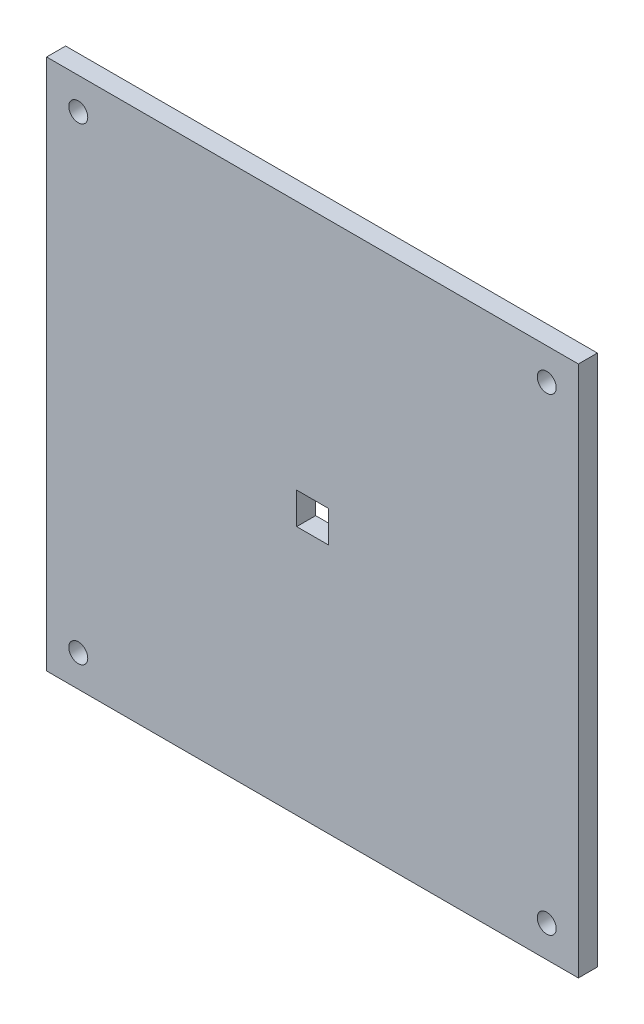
ISO-10303-21;
HEADER;
FILE_DESCRIPTION(('STEP AP214'),'2;1');
FILE_NAME('part.step','',(''),(''),'','','');
FILE_SCHEMA(('AUTOMOTIVE_DESIGN { 1 0 10303 214 1 1 1 1 }'));
ENDSEC;
DATA;
#1=APPLICATION_CONTEXT('core data for automotive mechanical design processes');
#2=APPLICATION_PROTOCOL_DEFINITION('international standard','automotive_design',2000,#1);
#3=PRODUCT_CONTEXT('',#1,'mechanical');
#4=PRODUCT('Part','Part','',(#3));
#5=PRODUCT_RELATED_PRODUCT_CATEGORY('part','',(#4));
#6=PRODUCT_DEFINITION_FORMATION('','',#4);
#7=PRODUCT_DEFINITION_CONTEXT('part definition',#1,'design');
#8=PRODUCT_DEFINITION('design','',#6,#7);
#9=PRODUCT_DEFINITION_SHAPE('','',#8);
#10=(LENGTH_UNIT() NAMED_UNIT(*) SI_UNIT(.MILLI.,.METRE.));
#11=(NAMED_UNIT(*) PLANE_ANGLE_UNIT() SI_UNIT($,.RADIAN.));
#12=(NAMED_UNIT(*) SI_UNIT($,.STERADIAN.) SOLID_ANGLE_UNIT());
#13=UNCERTAINTY_MEASURE_WITH_UNIT(LENGTH_MEASURE(1.E-05),#10,'distance_accuracy_value','');
#14=(GEOMETRIC_REPRESENTATION_CONTEXT(3) GLOBAL_UNCERTAINTY_ASSIGNED_CONTEXT((#13)) GLOBAL_UNIT_ASSIGNED_CONTEXT((#10,
#11,#12)) REPRESENTATION_CONTEXT('',''));
#15=CARTESIAN_POINT('',(0.,0.,0.));
#16=DIRECTION('',(0.,0.,1.));
#17=DIRECTION('',(1.,0.,0.));
#18=AXIS2_PLACEMENT_3D('',#15,#16,#17);
#19=CARTESIAN_POINT('',(0.,0.,3.));
#20=DIRECTION('',(0.,0.,1.));
#21=DIRECTION('',(1.,0.,0.));
#22=AXIS2_PLACEMENT_3D('',#19,#20,#21);
#23=PLANE('',#22);
#24=CARTESIAN_POINT('',(37.0000000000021,-36.9999999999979,3.));
#25=DIRECTION('',(0.,0.,1.));
#26=DIRECTION('',(1.,0.,0.));
#27=AXIS2_PLACEMENT_3D('',#24,#25,#26);
#28=CIRCLE('',#27,1.50000000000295);
#29=CARTESIAN_POINT('',(38.500000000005,-36.9999999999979,3.));
#30=VERTEX_POINT('',#29);
#31=EDGE_CURVE('E245',#30,#30,#28,.T.);
#32=ORIENTED_EDGE('',*,*,#31,.F.);
#33=EDGE_LOOP('',(#32));
#34=FACE_BOUND('',#33,.T.);
#35=CARTESIAN_POINT('',(-37.,37.,3.));
#36=DIRECTION('',(0.,0.,1.));
#37=DIRECTION('',(1.,0.,0.));
#38=AXIS2_PLACEMENT_3D('',#35,#36,#37);
#39=CIRCLE('',#38,1.5);
#40=CARTESIAN_POINT('',(-35.5,37.,3.));
#41=VERTEX_POINT('',#40);
#42=EDGE_CURVE('E127',#41,#41,#39,.T.);
#43=ORIENTED_EDGE('',*,*,#42,.F.);
#44=EDGE_LOOP('',(#43));
#45=FACE_BOUND('',#44,.T.);
#46=DIRECTION('',(0.,1.,0.));
#47=VECTOR('',#46,1.);
#48=CARTESIAN_POINT('',(42.,42.,3.));
#49=LINE('',#48,#47);
#50=CARTESIAN_POINT('',(42.,-42.,3.));
#51=VERTEX_POINT('',#50);
#52=CARTESIAN_POINT('',(42.,42.,3.));
#53=VERTEX_POINT('',#52);
#54=EDGE_CURVE('E137',#51,#53,#49,.T.);
#55=ORIENTED_EDGE('',*,*,#54,.T.);
#56=DIRECTION('',(-1.,0.,0.));
#57=VECTOR('',#56,1.);
#58=CARTESIAN_POINT('',(-42.,42.,3.));
#59=LINE('',#58,#57);
#60=CARTESIAN_POINT('',(-42.,42.,3.));
#61=VERTEX_POINT('',#60);
#62=EDGE_CURVE('E140',#53,#61,#59,.T.);
#63=ORIENTED_EDGE('',*,*,#62,.T.);
#64=DIRECTION('',(0.,-1.,0.));
#65=VECTOR('',#64,1.);
#66=CARTESIAN_POINT('',(-42.,42.,3.));
#67=LINE('',#66,#65);
#68=CARTESIAN_POINT('',(-42.,-42.,3.));
#69=VERTEX_POINT('',#68);
#70=EDGE_CURVE('E143',#61,#69,#67,.T.);
#71=ORIENTED_EDGE('',*,*,#70,.T.);
#72=DIRECTION('',(1.,0.,0.));
#73=VECTOR('',#72,1.);
#74=CARTESIAN_POINT('',(-42.,-42.,3.));
#75=LINE('',#74,#73);
#76=EDGE_CURVE('E145',#69,#51,#75,.T.);
#77=ORIENTED_EDGE('',*,*,#76,.T.);
#78=EDGE_LOOP('',(#55,#63,#71,#77));
#79=FACE_BOUND('',#78,.T.);
#80=DIRECTION('',(-1.,0.,0.));
#81=VECTOR('',#80,1.);
#82=CARTESIAN_POINT('',(-2.50000000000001,2.50000000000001,3.));
#83=LINE('',#82,#81);
#84=CARTESIAN_POINT('',(2.49999999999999,2.50000000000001,3.));
#85=VERTEX_POINT('',#84);
#86=CARTESIAN_POINT('',(-2.50000000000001,2.50000000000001,3.));
#87=VERTEX_POINT('',#86);
#88=EDGE_CURVE('E106',#85,#87,#83,.T.);
#89=ORIENTED_EDGE('',*,*,#88,.F.);
#90=DIRECTION('',(0.,1.,0.));
#91=VECTOR('',#90,1.);
#92=CARTESIAN_POINT('',(2.49999999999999,2.50000000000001,3.));
#93=LINE('',#92,#91);
#94=CARTESIAN_POINT('',(2.5,-2.49999999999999,3.));
#95=VERTEX_POINT('',#94);
#96=EDGE_CURVE('E98',#95,#85,#93,.T.);
#97=ORIENTED_EDGE('',*,*,#96,.F.);
#98=DIRECTION('',(1.,0.,0.));
#99=VECTOR('',#98,1.);
#100=CARTESIAN_POINT('',(-2.5,-2.49999999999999,3.));
#101=LINE('',#100,#99);
#102=CARTESIAN_POINT('',(-2.5,-2.49999999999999,3.));
#103=VERTEX_POINT('',#102);
#104=EDGE_CURVE('E121',#103,#95,#101,.T.);
#105=ORIENTED_EDGE('',*,*,#104,.F.);
#106=DIRECTION('',(0.,-1.,0.));
#107=VECTOR('',#106,1.);
#108=CARTESIAN_POINT('',(-2.50000000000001,2.50000000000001,3.));
#109=LINE('',#108,#107);
#110=EDGE_CURVE('E119',#87,#103,#109,.T.);
#111=ORIENTED_EDGE('',*,*,#110,.F.);
#112=EDGE_LOOP('',(#89,#97,#105,#111));
#113=FACE_BOUND('',#112,.T.);
#114=CARTESIAN_POINT('',(37.,37.0000000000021,3.));
#115=DIRECTION('',(0.,0.,1.));
#116=DIRECTION('',(1.,0.,0.));
#117=AXIS2_PLACEMENT_3D('',#114,#115,#116);
#118=CIRCLE('',#117,1.50000000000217);
#119=CARTESIAN_POINT('',(38.5000000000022,37.0000000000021,3.));
#120=VERTEX_POINT('',#119);
#121=EDGE_CURVE('E251',#120,#120,#118,.T.);
#122=ORIENTED_EDGE('',*,*,#121,.F.);
#123=EDGE_LOOP('',(#122));
#124=FACE_BOUND('',#123,.T.);
#125=CARTESIAN_POINT('',(-36.9999999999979,-37.,3.));
#126=DIRECTION('',(0.,0.,1.));
#127=DIRECTION('',(1.,0.,0.));
#128=AXIS2_PLACEMENT_3D('',#125,#126,#127);
#129=CIRCLE('',#128,1.5000000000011);
#130=CARTESIAN_POINT('',(-35.4999999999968,-37.,3.));
#131=VERTEX_POINT('',#130);
#132=EDGE_CURVE('E236',#131,#131,#129,.T.);
#133=ORIENTED_EDGE('',*,*,#132,.F.);
#134=EDGE_LOOP('',(#133));
#135=FACE_BOUND('',#134,.T.);
#136=ADVANCED_FACE('F33',(#34,#45,#79,#113,#124,#135),#23,.T.);
#137=CARTESIAN_POINT('',(0.,0.,0.));
#138=DIRECTION('',(0.,0.,1.));
#139=DIRECTION('',(1.,0.,0.));
#140=AXIS2_PLACEMENT_3D('',#137,#138,#139);
#141=PLANE('',#140);
#142=DIRECTION('',(0.,1.,0.));
#143=VECTOR('',#142,1.);
#144=CARTESIAN_POINT('',(42.,42.,0.));
#145=LINE('',#144,#143);
#146=CARTESIAN_POINT('',(42.,-42.,0.));
#147=VERTEX_POINT('',#146);
#148=CARTESIAN_POINT('',(42.,42.,0.));
#149=VERTEX_POINT('',#148);
#150=EDGE_CURVE('E114',#147,#149,#145,.T.);
#151=ORIENTED_EDGE('',*,*,#150,.F.);
#152=DIRECTION('',(1.,0.,0.));
#153=VECTOR('',#152,1.);
#154=CARTESIAN_POINT('',(-42.,-42.,0.));
#155=LINE('',#154,#153);
#156=CARTESIAN_POINT('',(-42.,-42.,0.));
#157=VERTEX_POINT('',#156);
#158=EDGE_CURVE('E141',#157,#147,#155,.T.);
#159=ORIENTED_EDGE('',*,*,#158,.F.);
#160=DIRECTION('',(0.,-1.,0.));
#161=VECTOR('',#160,1.);
#162=CARTESIAN_POINT('',(-42.,42.,0.));
#163=LINE('',#162,#161);
#164=CARTESIAN_POINT('',(-42.,42.,0.));
#165=VERTEX_POINT('',#164);
#166=EDGE_CURVE('E152',#165,#157,#163,.T.);
#167=ORIENTED_EDGE('',*,*,#166,.F.);
#168=DIRECTION('',(-1.,0.,0.));
#169=VECTOR('',#168,1.);
#170=CARTESIAN_POINT('',(-42.,42.,0.));
#171=LINE('',#170,#169);
#172=EDGE_CURVE('E150',#149,#165,#171,.T.);
#173=ORIENTED_EDGE('',*,*,#172,.F.);
#174=EDGE_LOOP('',(#151,#159,#167,#173));
#175=FACE_BOUND('',#174,.T.);
#176=DIRECTION('',(0.,1.,0.));
#177=VECTOR('',#176,1.);
#178=CARTESIAN_POINT('',(2.49999999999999,2.50000000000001,0.));
#179=LINE('',#178,#177);
#180=CARTESIAN_POINT('',(2.5,-2.49999999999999,0.));
#181=VERTEX_POINT('',#180);
#182=CARTESIAN_POINT('',(2.49999999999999,2.50000000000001,0.));
#183=VERTEX_POINT('',#182);
#184=EDGE_CURVE('E56',#181,#183,#179,.T.);
#185=ORIENTED_EDGE('',*,*,#184,.T.);
#186=DIRECTION('',(-1.,0.,0.));
#187=VECTOR('',#186,1.);
#188=CARTESIAN_POINT('',(-2.50000000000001,2.50000000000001,0.));
#189=LINE('',#188,#187);
#190=CARTESIAN_POINT('',(-2.50000000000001,2.50000000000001,0.));
#191=VERTEX_POINT('',#190);
#192=EDGE_CURVE('E113',#183,#191,#189,.T.);
#193=ORIENTED_EDGE('',*,*,#192,.T.);
#194=DIRECTION('',(0.,-1.,0.));
#195=VECTOR('',#194,1.);
#196=CARTESIAN_POINT('',(-2.50000000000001,2.50000000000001,0.));
#197=LINE('',#196,#195);
#198=CARTESIAN_POINT('',(-2.5,-2.49999999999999,0.));
#199=VERTEX_POINT('',#198);
#200=EDGE_CURVE('E129',#191,#199,#197,.T.);
#201=ORIENTED_EDGE('',*,*,#200,.T.);
#202=DIRECTION('',(1.,0.,0.));
#203=VECTOR('',#202,1.);
#204=CARTESIAN_POINT('',(-2.5,-2.49999999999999,0.));
#205=LINE('',#204,#203);
#206=EDGE_CURVE('E107',#199,#181,#205,.T.);
#207=ORIENTED_EDGE('',*,*,#206,.T.);
#208=EDGE_LOOP('',(#185,#193,#201,#207));
#209=FACE_BOUND('',#208,.T.);
#210=CARTESIAN_POINT('',(-37.,37.,0.));
#211=DIRECTION('',(0.,0.,1.));
#212=DIRECTION('',(1.,0.,0.));
#213=AXIS2_PLACEMENT_3D('',#210,#211,#212);
#214=CIRCLE('',#213,1.5);
#215=CARTESIAN_POINT('',(-35.5,37.,0.));
#216=VERTEX_POINT('',#215);
#217=EDGE_CURVE('E254',#216,#216,#214,.T.);
#218=ORIENTED_EDGE('',*,*,#217,.T.);
#219=EDGE_LOOP('',(#218));
#220=FACE_BOUND('',#219,.T.);
#221=CARTESIAN_POINT('',(37.,37.0000000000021,0.));
#222=DIRECTION('',(0.,0.,1.));
#223=DIRECTION('',(1.,0.,0.));
#224=AXIS2_PLACEMENT_3D('',#221,#222,#223);
#225=CIRCLE('',#224,1.50000000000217);
#226=CARTESIAN_POINT('',(38.5000000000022,37.0000000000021,0.));
#227=VERTEX_POINT('',#226);
#228=EDGE_CURVE('E248',#227,#227,#225,.T.);
#229=ORIENTED_EDGE('',*,*,#228,.T.);
#230=EDGE_LOOP('',(#229));
#231=FACE_BOUND('',#230,.T.);
#232=CARTESIAN_POINT('',(37.0000000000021,-36.9999999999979,0.));
#233=DIRECTION('',(0.,0.,1.));
#234=DIRECTION('',(1.,0.,0.));
#235=AXIS2_PLACEMENT_3D('',#232,#233,#234);
#236=CIRCLE('',#235,1.50000000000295);
#237=CARTESIAN_POINT('',(38.500000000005,-36.9999999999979,0.));
#238=VERTEX_POINT('',#237);
#239=EDGE_CURVE('E242',#238,#238,#236,.T.);
#240=ORIENTED_EDGE('',*,*,#239,.T.);
#241=EDGE_LOOP('',(#240));
#242=FACE_BOUND('',#241,.T.);
#243=CARTESIAN_POINT('',(-36.9999999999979,-37.,0.));
#244=DIRECTION('',(0.,0.,1.));
#245=DIRECTION('',(1.,0.,0.));
#246=AXIS2_PLACEMENT_3D('',#243,#244,#245);
#247=CIRCLE('',#246,1.5000000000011);
#248=CARTESIAN_POINT('',(-35.4999999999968,-37.,0.));
#249=VERTEX_POINT('',#248);
#250=EDGE_CURVE('E239',#249,#249,#247,.T.);
#251=ORIENTED_EDGE('',*,*,#250,.T.);
#252=EDGE_LOOP('',(#251));
#253=FACE_BOUND('',#252,.T.);
#254=ADVANCED_FACE('F170',(#175,#209,#220,#231,#242,#253),#141,.F.);
#255=CARTESIAN_POINT('',(42.,42.,3.));
#256=DIRECTION('',(-1.,0.,0.));
#257=DIRECTION('',(0.,-1.,0.));
#258=AXIS2_PLACEMENT_3D('',#255,#256,#257);
#259=PLANE('',#258);
#260=ORIENTED_EDGE('',*,*,#150,.T.);
#261=DIRECTION('',(0.,0.,-1.));
#262=VECTOR('',#261,1.);
#263=CARTESIAN_POINT('',(42.,42.,3.));
#264=LINE('',#263,#262);
#265=EDGE_CURVE('E11',#53,#149,#264,.T.);
#266=ORIENTED_EDGE('',*,*,#265,.F.);
#267=ORIENTED_EDGE('',*,*,#54,.F.);
#268=DIRECTION('',(0.,0.,-1.));
#269=VECTOR('',#268,1.);
#270=CARTESIAN_POINT('',(42.,-42.,3.));
#271=LINE('',#270,#269);
#272=EDGE_CURVE('E147',#51,#147,#271,.T.);
#273=ORIENTED_EDGE('',*,*,#272,.T.);
#274=EDGE_LOOP('',(#260,#266,#267,#273));
#275=FACE_BOUND('',#274,.T.);
#276=ADVANCED_FACE('F35',(#275),#259,.F.);
#277=CARTESIAN_POINT('',(-42.,42.,3.));
#278=DIRECTION('',(0.,-1.,0.));
#279=DIRECTION('',(0.,0.,-1.));
#280=AXIS2_PLACEMENT_3D('',#277,#278,#279);
#281=PLANE('',#280);
#282=ORIENTED_EDGE('',*,*,#172,.T.);
#283=DIRECTION('',(0.,0.,-1.));
#284=VECTOR('',#283,1.);
#285=CARTESIAN_POINT('',(-42.,42.,3.));
#286=LINE('',#285,#284);
#287=EDGE_CURVE('E41',#61,#165,#286,.T.);
#288=ORIENTED_EDGE('',*,*,#287,.F.);
#289=ORIENTED_EDGE('',*,*,#62,.F.);
#290=ORIENTED_EDGE('',*,*,#265,.T.);
#291=EDGE_LOOP('',(#282,#288,#289,#290));
#292=FACE_BOUND('',#291,.T.);
#293=ADVANCED_FACE('F180',(#292),#281,.F.);
#294=CARTESIAN_POINT('',(-42.,42.,3.));
#295=DIRECTION('',(1.,0.,0.));
#296=DIRECTION('',(0.,1.,0.));
#297=AXIS2_PLACEMENT_3D('',#294,#295,#296);
#298=PLANE('',#297);
#299=ORIENTED_EDGE('',*,*,#166,.T.);
#300=DIRECTION('',(0.,0.,-1.));
#301=VECTOR('',#300,1.);
#302=CARTESIAN_POINT('',(-42.,-42.,3.));
#303=LINE('',#302,#301);
#304=EDGE_CURVE('E157',#69,#157,#303,.T.);
#305=ORIENTED_EDGE('',*,*,#304,.F.);
#306=ORIENTED_EDGE('',*,*,#70,.F.);
#307=ORIENTED_EDGE('',*,*,#287,.T.);
#308=EDGE_LOOP('',(#299,#305,#306,#307));
#309=FACE_BOUND('',#308,.T.);
#310=ADVANCED_FACE('F164',(#309),#298,.F.);
#311=CARTESIAN_POINT('',(-42.,-42.,3.));
#312=DIRECTION('',(0.,1.,0.));
#313=DIRECTION('',(0.,0.,1.));
#314=AXIS2_PLACEMENT_3D('',#311,#312,#313);
#315=PLANE('',#314);
#316=ORIENTED_EDGE('',*,*,#158,.T.);
#317=ORIENTED_EDGE('',*,*,#272,.F.);
#318=ORIENTED_EDGE('',*,*,#76,.F.);
#319=ORIENTED_EDGE('',*,*,#304,.T.);
#320=EDGE_LOOP('',(#316,#317,#318,#319));
#321=FACE_BOUND('',#320,.T.);
#322=ADVANCED_FACE('F174',(#321),#315,.F.);
#323=CARTESIAN_POINT('',(2.49999999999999,2.50000000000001,3.));
#324=DIRECTION('',(-1.,0.,0.));
#325=DIRECTION('',(0.,-1.,0.));
#326=AXIS2_PLACEMENT_3D('',#323,#324,#325);
#327=PLANE('',#326);
#328=ORIENTED_EDGE('',*,*,#184,.F.);
#329=DIRECTION('',(0.,0.,-1.));
#330=VECTOR('',#329,1.);
#331=CARTESIAN_POINT('',(2.5,-2.49999999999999,3.));
#332=LINE('',#331,#330);
#333=EDGE_CURVE('E102',#95,#181,#332,.T.);
#334=ORIENTED_EDGE('',*,*,#333,.F.);
#335=ORIENTED_EDGE('',*,*,#96,.T.);
#336=DIRECTION('',(0.,0.,-1.));
#337=VECTOR('',#336,1.);
#338=CARTESIAN_POINT('',(2.49999999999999,2.50000000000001,3.));
#339=LINE('',#338,#337);
#340=EDGE_CURVE('E101',#85,#183,#339,.T.);
#341=ORIENTED_EDGE('',*,*,#340,.T.);
#342=EDGE_LOOP('',(#328,#334,#335,#341));
#343=FACE_BOUND('',#342,.T.);
#344=ADVANCED_FACE('F100',(#343),#327,.T.);
#345=CARTESIAN_POINT('',(-2.50000000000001,2.50000000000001,3.));
#346=DIRECTION('',(0.,-1.,0.));
#347=DIRECTION('',(0.,0.,-1.));
#348=AXIS2_PLACEMENT_3D('',#345,#346,#347);
#349=PLANE('',#348);
#350=ORIENTED_EDGE('',*,*,#192,.F.);
#351=ORIENTED_EDGE('',*,*,#340,.F.);
#352=ORIENTED_EDGE('',*,*,#88,.T.);
#353=DIRECTION('',(0.,0.,-1.));
#354=VECTOR('',#353,1.);
#355=CARTESIAN_POINT('',(-2.50000000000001,2.50000000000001,3.));
#356=LINE('',#355,#354);
#357=EDGE_CURVE('E115',#87,#191,#356,.T.);
#358=ORIENTED_EDGE('',*,*,#357,.T.);
#359=EDGE_LOOP('',(#350,#351,#352,#358));
#360=FACE_BOUND('',#359,.T.);
#361=ADVANCED_FACE('F110',(#360),#349,.T.);
#362=CARTESIAN_POINT('',(-2.50000000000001,2.50000000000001,3.));
#363=DIRECTION('',(1.,0.,0.));
#364=DIRECTION('',(0.,1.,0.));
#365=AXIS2_PLACEMENT_3D('',#362,#363,#364);
#366=PLANE('',#365);
#367=ORIENTED_EDGE('',*,*,#200,.F.);
#368=ORIENTED_EDGE('',*,*,#357,.F.);
#369=ORIENTED_EDGE('',*,*,#110,.T.);
#370=DIRECTION('',(0.,0.,-1.));
#371=VECTOR('',#370,1.);
#372=CARTESIAN_POINT('',(-2.5,-2.49999999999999,3.));
#373=LINE('',#372,#371);
#374=EDGE_CURVE('E48',#103,#199,#373,.T.);
#375=ORIENTED_EDGE('',*,*,#374,.T.);
#376=EDGE_LOOP('',(#367,#368,#369,#375));
#377=FACE_BOUND('',#376,.T.);
#378=ADVANCED_FACE('F206',(#377),#366,.T.);
#379=CARTESIAN_POINT('',(-2.5,-2.49999999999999,3.));
#380=DIRECTION('',(0.,1.,0.));
#381=DIRECTION('',(0.,0.,1.));
#382=AXIS2_PLACEMENT_3D('',#379,#380,#381);
#383=PLANE('',#382);
#384=ORIENTED_EDGE('',*,*,#206,.F.);
#385=ORIENTED_EDGE('',*,*,#374,.F.);
#386=ORIENTED_EDGE('',*,*,#104,.T.);
#387=ORIENTED_EDGE('',*,*,#333,.T.);
#388=EDGE_LOOP('',(#384,#385,#386,#387));
#389=FACE_BOUND('',#388,.T.);
#390=ADVANCED_FACE('F210',(#389),#383,.T.);
#391=CARTESIAN_POINT('',(-37.,37.,3.));
#392=DIRECTION('',(0.,0.,-1.));
#393=DIRECTION('',(-1.,0.,0.));
#394=AXIS2_PLACEMENT_3D('',#391,#392,#393);
#395=CYLINDRICAL_SURFACE('',#394,1.5);
#396=ORIENTED_EDGE('',*,*,#42,.T.);
#397=EDGE_LOOP('',(#396));
#398=FACE_BOUND('',#397,.T.);
#399=ORIENTED_EDGE('',*,*,#217,.F.);
#400=EDGE_LOOP('',(#399));
#401=FACE_BOUND('',#400,.T.);
#402=ADVANCED_FACE('F216',(#398,#401),#395,.F.);
#403=CARTESIAN_POINT('',(37.,37.0000000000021,3.));
#404=DIRECTION('',(0.,0.,-1.));
#405=DIRECTION('',(-1.,0.,0.));
#406=AXIS2_PLACEMENT_3D('',#403,#404,#405);
#407=CYLINDRICAL_SURFACE('',#406,1.50000000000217);
#408=ORIENTED_EDGE('',*,*,#121,.T.);
#409=EDGE_LOOP('',(#408));
#410=FACE_BOUND('',#409,.T.);
#411=ORIENTED_EDGE('',*,*,#228,.F.);
#412=EDGE_LOOP('',(#411));
#413=FACE_BOUND('',#412,.T.);
#414=ADVANCED_FACE('F219',(#410,#413),#407,.F.);
#415=CARTESIAN_POINT('',(37.0000000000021,-36.9999999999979,3.));
#416=DIRECTION('',(0.,0.,-1.));
#417=DIRECTION('',(-1.,0.,0.));
#418=AXIS2_PLACEMENT_3D('',#415,#416,#417);
#419=CYLINDRICAL_SURFACE('',#418,1.50000000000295);
#420=ORIENTED_EDGE('',*,*,#31,.T.);
#421=EDGE_LOOP('',(#420));
#422=FACE_BOUND('',#421,.T.);
#423=ORIENTED_EDGE('',*,*,#239,.F.);
#424=EDGE_LOOP('',(#423));
#425=FACE_BOUND('',#424,.T.);
#426=ADVANCED_FACE('F223',(#422,#425),#419,.F.);
#427=CARTESIAN_POINT('',(-36.9999999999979,-37.,3.));
#428=DIRECTION('',(0.,0.,-1.));
#429=DIRECTION('',(-1.,0.,0.));
#430=AXIS2_PLACEMENT_3D('',#427,#428,#429);
#431=CYLINDRICAL_SURFACE('',#430,1.5000000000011);
#432=ORIENTED_EDGE('',*,*,#132,.T.);
#433=EDGE_LOOP('',(#432));
#434=FACE_BOUND('',#433,.T.);
#435=ORIENTED_EDGE('',*,*,#250,.F.);
#436=EDGE_LOOP('',(#435));
#437=FACE_BOUND('',#436,.T.);
#438=ADVANCED_FACE('F227',(#434,#437),#431,.F.);
#439=CLOSED_SHELL('',(#136,#254,#276,#293,#310,#322,#344,#361,#378,#390,#402,#414,#426,#438));
#440=MANIFOLD_SOLID_BREP('B2',#439);
#441=ADVANCED_BREP_SHAPE_REPRESENTATION('',(#18,#440),#14);
#442=SHAPE_DEFINITION_REPRESENTATION(#9,#441);
ENDSEC;
END-ISO-10303-21;
